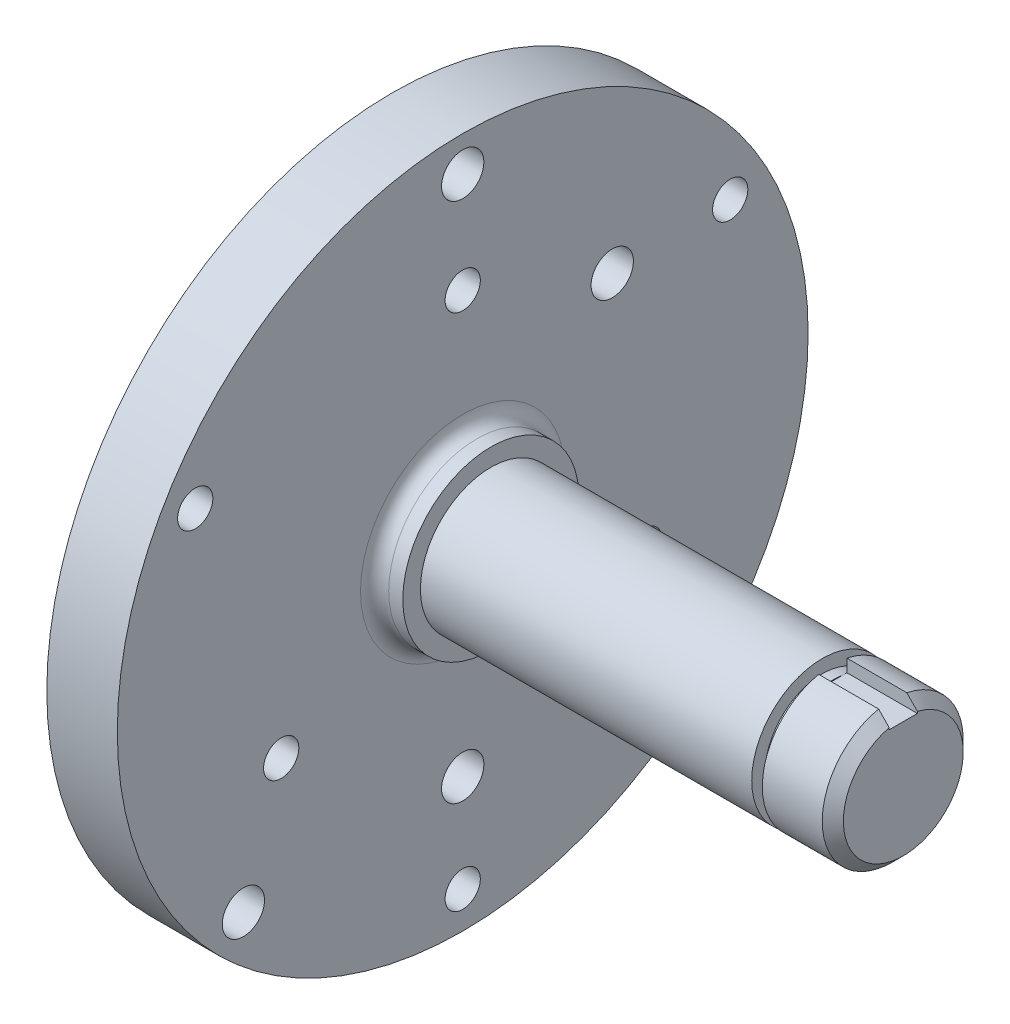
ISO-10303-21;
HEADER;
FILE_DESCRIPTION(('STEP AP214'),'2;1');
FILE_NAME('part.step','',(''),(''),'','','');
FILE_SCHEMA(('AUTOMOTIVE_DESIGN { 1 0 10303 214 1 1 1 1 }'));
ENDSEC;
DATA;
#1=APPLICATION_CONTEXT('core data for automotive mechanical design processes');
#2=APPLICATION_PROTOCOL_DEFINITION('international standard','automotive_design',2000,#1);
#3=PRODUCT_CONTEXT('',#1,'mechanical');
#4=PRODUCT('Part','Part','',(#3));
#5=PRODUCT_RELATED_PRODUCT_CATEGORY('part','',(#4));
#6=PRODUCT_DEFINITION_FORMATION('','',#4);
#7=PRODUCT_DEFINITION_CONTEXT('part definition',#1,'design');
#8=PRODUCT_DEFINITION('design','',#6,#7);
#9=PRODUCT_DEFINITION_SHAPE('','',#8);
#10=(LENGTH_UNIT() NAMED_UNIT(*) SI_UNIT(.MILLI.,.METRE.));
#11=(NAMED_UNIT(*) PLANE_ANGLE_UNIT() SI_UNIT($,.RADIAN.));
#12=(NAMED_UNIT(*) SI_UNIT($,.STERADIAN.) SOLID_ANGLE_UNIT());
#13=UNCERTAINTY_MEASURE_WITH_UNIT(LENGTH_MEASURE(1.E-05),#10,'distance_accuracy_value','');
#14=(GEOMETRIC_REPRESENTATION_CONTEXT(3) GLOBAL_UNCERTAINTY_ASSIGNED_CONTEXT((#13)) GLOBAL_UNIT_ASSIGNED_CONTEXT((#10,
#11,#12)) REPRESENTATION_CONTEXT('',''));
#15=CARTESIAN_POINT('',(0.,0.,0.));
#16=DIRECTION('',(0.,0.,1.));
#17=DIRECTION('',(1.,0.,0.));
#18=AXIS2_PLACEMENT_3D('',#15,#16,#17);
#19=CARTESIAN_POINT('',(58.5,8.50000000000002,0.));
#20=DIRECTION('',(-1.,0.,0.));
#21=DIRECTION('',(0.,0.,1.));
#22=AXIS2_PLACEMENT_3D('',#19,#20,#21);
#23=PLANE('',#22);
#24=CARTESIAN_POINT('',(58.5,0.,0.));
#25=DIRECTION('',(-1.,0.,0.));
#26=DIRECTION('',(0.,0.,1.));
#27=AXIS2_PLACEMENT_3D('',#24,#25,#26);
#28=CIRCLE('',#27,8.50000000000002);
#29=CARTESIAN_POINT('',(58.5,8.26135582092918,-2.));
#30=VERTEX_POINT('',#29);
#31=CARTESIAN_POINT('',(58.5,8.26135582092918,2.));
#32=VERTEX_POINT('',#31);
#33=EDGE_CURVE('E11',#30,#32,#28,.T.);
#34=ORIENTED_EDGE('',*,*,#33,.F.);
#35=DIRECTION('',(0.,1.,0.));
#36=VECTOR('',#35,1.);
#37=CARTESIAN_POINT('',(58.5,12.231945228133,-2.));
#38=LINE('',#37,#36);
#39=CARTESIAN_POINT('',(58.5,8.,-2.));
#40=VERTEX_POINT('',#39);
#41=EDGE_CURVE('E98',#40,#30,#38,.T.);
#42=ORIENTED_EDGE('',*,*,#41,.F.);
#43=DIRECTION('',(0.,0.,-1.));
#44=VECTOR('',#43,1.);
#45=CARTESIAN_POINT('',(58.5,8.,2.));
#46=LINE('',#45,#44);
#47=CARTESIAN_POINT('',(58.5,8.,2.));
#48=VERTEX_POINT('',#47);
#49=EDGE_CURVE('E97',#48,#40,#46,.T.);
#50=ORIENTED_EDGE('',*,*,#49,.F.);
#51=DIRECTION('',(0.,-1.,0.));
#52=VECTOR('',#51,1.);
#53=CARTESIAN_POINT('',(58.5,12.231945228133,2.));
#54=LINE('',#53,#52);
#55=EDGE_CURVE('E87',#32,#48,#54,.T.);
#56=ORIENTED_EDGE('',*,*,#55,.F.);
#57=EDGE_LOOP('',(#34,#42,#50,#56));
#58=FACE_BOUND('',#57,.T.);
#59=ADVANCED_FACE('F33',(#58),#23,.F.);
#60=CARTESIAN_POINT('',(58.5,0.,0.));
#61=DIRECTION('',(-1.,0.,0.));
#62=DIRECTION('',(0.,0.,1.));
#63=AXIS2_PLACEMENT_3D('',#60,#61,#62);
#64=CONICAL_SURFACE('',#63,8.50000000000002,0.785398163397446);
#65=CARTESIAN_POINT('',(57.,0.,0.));
#66=DIRECTION('',(-1.,0.,0.));
#67=DIRECTION('',(0.,0.,1.));
#68=AXIS2_PLACEMENT_3D('',#65,#66,#67);
#69=CIRCLE('',#68,10.);
#70=CARTESIAN_POINT('',(57.,9.79795897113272,-2.));
#71=VERTEX_POINT('',#70);
#72=CARTESIAN_POINT('',(57.,9.79795897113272,2.));
#73=VERTEX_POINT('',#72);
#74=EDGE_CURVE('E40',#71,#73,#69,.T.);
#75=ORIENTED_EDGE('',*,*,#74,.F.);
#76=CARTESIAN_POINT('',(54.9971938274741,11.8350055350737,-2.));
#77=CARTESIAN_POINT('',(55.2751644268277,11.553085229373,-2.));
#78=CARTESIAN_POINT('',(55.5530034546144,11.2710349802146,-2.));
#79=CARTESIAN_POINT('',(56.1083316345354,10.7065888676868,-2.));
#80=CARTESIAN_POINT('',(56.3858207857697,10.424193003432,-2.));
#81=CARTESIAN_POINT('',(56.9403495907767,9.85898306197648,-2.));
#82=CARTESIAN_POINT('',(57.2173892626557,9.57616900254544,-2.));
#83=CARTESIAN_POINT('',(57.7709001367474,9.00998552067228,-2.));
#84=CARTESIAN_POINT('',(58.0473713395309,8.72661609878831,-2.));
#85=CARTESIAN_POINT('',(58.5995749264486,8.15913155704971,-2.));
#86=CARTESIAN_POINT('',(58.8753072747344,7.87501640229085,-2.));
#87=CARTESIAN_POINT('',(59.425743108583,7.3057944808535,-2.));
#88=CARTESIAN_POINT('',(59.7004466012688,7.0206877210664,-2.));
#89=CARTESIAN_POINT('',(60.2484177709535,6.44907146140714,-2.));
#90=CARTESIAN_POINT('',(60.5216853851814,6.16256190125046,-2.));
#91=CARTESIAN_POINT('',(60.929972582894,5.73126239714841,-2.));
#92=CARTESIAN_POINT('',(61.0658008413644,5.58723835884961,-2.));
#93=CARTESIAN_POINT('',(61.3367727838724,5.29854588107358,-2.));
#94=CARTESIAN_POINT('',(61.4719164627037,5.15387743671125,-2.));
#95=CARTESIAN_POINT('',(61.6066441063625,5.00882099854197,-2.));
#96=B_SPLINE_CURVE_WITH_KNOTS('',3,(#76,#77,#78,#79,#80,#81,#82,#83,#84,#85,#86,#87,#88,#89,#90,
#91,#92,#93,#94,#95),.UNSPECIFIED.,.F.,.F.,(4,2,2,2,2,2,2,2,2,4),(0.,1.1877377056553,
2.37547846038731,3.56317011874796,4.75086058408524,5.93860766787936,7.12634651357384,
8.31413685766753,8.90804578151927,9.50195921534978),.UNSPECIFIED.);
#97=EDGE_CURVE('E55',#71,#30,#96,.T.);
#98=ORIENTED_EDGE('',*,*,#97,.T.);
#99=ORIENTED_EDGE('',*,*,#33,.T.);
#100=CARTESIAN_POINT('',(61.6066441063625,5.00882099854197,2.));
#101=CARTESIAN_POINT('',(61.4719164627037,5.15387743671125,2.));
#102=CARTESIAN_POINT('',(61.3367727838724,5.29854588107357,2.));
#103=CARTESIAN_POINT('',(61.0658008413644,5.5872383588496,2.));
#104=CARTESIAN_POINT('',(60.929972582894,5.7312623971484,2.));
#105=CARTESIAN_POINT('',(60.5216853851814,6.16256190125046,2.));
#106=CARTESIAN_POINT('',(60.2484177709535,6.44907146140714,2.));
#107=CARTESIAN_POINT('',(59.7004466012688,7.0206877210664,2.));
#108=CARTESIAN_POINT('',(59.425743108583,7.30579448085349,2.));
#109=CARTESIAN_POINT('',(58.8753072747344,7.87501640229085,2.));
#110=CARTESIAN_POINT('',(58.5995749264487,8.15913155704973,2.));
#111=CARTESIAN_POINT('',(58.0473713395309,8.72661609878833,2.));
#112=CARTESIAN_POINT('',(57.7709001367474,9.00998552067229,2.));
#113=CARTESIAN_POINT('',(57.2173892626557,9.57616900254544,2.));
#114=CARTESIAN_POINT('',(56.9403495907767,9.85898306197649,2.));
#115=CARTESIAN_POINT('',(56.3858207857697,10.424193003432,2.));
#116=CARTESIAN_POINT('',(56.1083316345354,10.7065888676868,2.));
#117=CARTESIAN_POINT('',(55.5530034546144,11.2710349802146,2.));
#118=CARTESIAN_POINT('',(55.2751644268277,11.553085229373,2.));
#119=CARTESIAN_POINT('',(54.9971938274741,11.8350055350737,2.));
#120=B_SPLINE_CURVE_WITH_KNOTS('',3,(#100,#101,#102,#103,#104,#105,#106,#107,#108,#109,#110,
#111,#112,#113,#114,#115,#116,#117,#118,#119),.UNSPECIFIED.,.F.,.F.,(4,2,2,2,2,2,2,2,2,4),(0.,
0.593913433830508,1.18782235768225,2.37561270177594,3.56335154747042,4.75109863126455,
5.93878909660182,7.12648075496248,8.31422150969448,9.50195921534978),.UNSPECIFIED.);
#121=EDGE_CURVE('E93',#32,#73,#120,.T.);
#122=ORIENTED_EDGE('',*,*,#121,.T.);
#123=EDGE_LOOP('',(#75,#98,#99,#122));
#124=FACE_BOUND('',#123,.T.);
#125=ADVANCED_FACE('F123',(#124),#64,.T.);
#126=CARTESIAN_POINT('',(-18.2864310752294,0.,0.));
#127=DIRECTION('',(-1.,0.,0.));
#128=DIRECTION('',(0.,0.,1.));
#129=AXIS2_PLACEMENT_3D('',#126,#127,#128);
#130=CYLINDRICAL_SURFACE('',#129,10.);
#131=CARTESIAN_POINT('',(48.5,0.,0.));
#132=DIRECTION('',(-1.,0.,0.));
#133=DIRECTION('',(0.,0.,1.));
#134=AXIS2_PLACEMENT_3D('',#131,#132,#133);
#135=CIRCLE('',#134,10.);
#136=CARTESIAN_POINT('',(48.5,9.79795897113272,-2.));
#137=VERTEX_POINT('',#136);
#138=CARTESIAN_POINT('',(48.5,9.79795897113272,2.));
#139=VERTEX_POINT('',#138);
#140=EDGE_CURVE('E230',#137,#139,#135,.T.);
#141=ORIENTED_EDGE('',*,*,#140,.F.);
#142=DIRECTION('',(-1.,0.,0.));
#143=VECTOR('',#142,1.);
#144=CARTESIAN_POINT('',(-18.2864310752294,9.79795897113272,-2.));
#145=LINE('',#144,#143);
#146=EDGE_CURVE('E121',#137,#71,#145,.F.);
#147=ORIENTED_EDGE('',*,*,#146,.T.);
#148=ORIENTED_EDGE('',*,*,#74,.T.);
#149=DIRECTION('',(-1.,0.,0.));
#150=VECTOR('',#149,1.);
#151=CARTESIAN_POINT('',(-18.2864310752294,9.79795897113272,2.));
#152=LINE('',#151,#150);
#153=EDGE_CURVE('E112',#73,#139,#152,.T.);
#154=ORIENTED_EDGE('',*,*,#153,.T.);
#155=EDGE_LOOP('',(#141,#147,#148,#154));
#156=FACE_BOUND('',#155,.T.);
#157=ADVANCED_FACE('F236',(#156),#130,.T.);
#158=CARTESIAN_POINT('',(48.5,8.12772302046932,0.));
#159=DIRECTION('',(1.,0.,0.));
#160=DIRECTION('',(0.,0.,-1.));
#161=AXIS2_PLACEMENT_3D('',#158,#159,#160);
#162=PLANE('',#161);
#163=DIRECTION('',(0.,0.,1.));
#164=VECTOR('',#163,1.);
#165=CARTESIAN_POINT('',(48.5,8.,2.));
#166=LINE('',#165,#164);
#167=CARTESIAN_POINT('',(48.5,8.,-2.));
#168=VERTEX_POINT('',#167);
#169=CARTESIAN_POINT('',(48.5,8.,-1.43522872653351));
#170=VERTEX_POINT('',#169);
#171=EDGE_CURVE('E47',#168,#170,#166,.T.);
#172=ORIENTED_EDGE('',*,*,#171,.F.);
#173=DIRECTION('',(0.,-1.,0.));
#174=VECTOR('',#173,1.);
#175=CARTESIAN_POINT('',(48.5,12.231945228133,-2.));
#176=LINE('',#175,#174);
#177=EDGE_CURVE('E115',#137,#168,#176,.T.);
#178=ORIENTED_EDGE('',*,*,#177,.F.);
#179=ORIENTED_EDGE('',*,*,#140,.T.);
#180=DIRECTION('',(0.,1.,0.));
#181=VECTOR('',#180,1.);
#182=CARTESIAN_POINT('',(48.5,12.231945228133,2.));
#183=LINE('',#182,#181);
#184=CARTESIAN_POINT('',(48.5,8.,2.));
#185=VERTEX_POINT('',#184);
#186=EDGE_CURVE('E110',#185,#139,#183,.T.);
#187=ORIENTED_EDGE('',*,*,#186,.F.);
#188=CARTESIAN_POINT('',(48.5,8.,1.43522872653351));
#189=VERTEX_POINT('',#188);
#190=EDGE_CURVE('E104',#189,#185,#166,.T.);
#191=ORIENTED_EDGE('',*,*,#190,.F.);
#192=CARTESIAN_POINT('',(48.5,0.,0.));
#193=DIRECTION('',(-1.,0.,0.));
#194=DIRECTION('',(0.,0.,1.));
#195=AXIS2_PLACEMENT_3D('',#192,#193,#194);
#196=CIRCLE('',#195,8.12772302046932);
#197=EDGE_CURVE('E226',#170,#189,#196,.T.);
#198=ORIENTED_EDGE('',*,*,#197,.F.);
#199=EDGE_LOOP('',(#172,#178,#179,#187,#191,#198));
#200=FACE_BOUND('',#199,.T.);
#201=ADVANCED_FACE('F243',(#200),#162,.F.);
#202=CARTESIAN_POINT('',(-18.2864310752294,0.,0.));
#203=DIRECTION('',(-1.,0.,0.));
#204=DIRECTION('',(0.,0.,1.));
#205=AXIS2_PLACEMENT_3D('',#202,#203,#204);
#206=CYLINDRICAL_SURFACE('',#205,8.12772302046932);
#207=CARTESIAN_POINT('',(47.,0.,0.));
#208=DIRECTION('',(-1.,0.,0.));
#209=DIRECTION('',(0.,0.,1.));
#210=AXIS2_PLACEMENT_3D('',#207,#208,#209);
#211=CIRCLE('',#210,8.12772302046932);
#212=CARTESIAN_POINT('',(47.,0.,8.12772302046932));
#213=VERTEX_POINT('',#212);
#214=EDGE_CURVE('E223',#213,#213,#211,.T.);
#215=ORIENTED_EDGE('',*,*,#214,.F.);
#216=EDGE_LOOP('',(#215));
#217=FACE_BOUND('',#216,.T.);
#218=EDGE_CURVE('E227',#189,#170,#196,.T.);
#219=ORIENTED_EDGE('',*,*,#218,.T.);
#220=ORIENTED_EDGE('',*,*,#197,.T.);
#221=EDGE_LOOP('',(#219,#220));
#222=FACE_BOUND('',#221,.T.);
#223=ADVANCED_FACE('F270',(#217,#222),#206,.T.);
#224=CARTESIAN_POINT('',(47.,10.,0.));
#225=DIRECTION('',(-1.,0.,0.));
#226=DIRECTION('',(0.,0.,1.));
#227=AXIS2_PLACEMENT_3D('',#224,#225,#226);
#228=PLANE('',#227);
#229=CARTESIAN_POINT('',(47.,0.,0.));
#230=DIRECTION('',(-1.,0.,0.));
#231=DIRECTION('',(0.,0.,1.));
#232=AXIS2_PLACEMENT_3D('',#229,#230,#231);
#233=CIRCLE('',#232,10.);
#234=CARTESIAN_POINT('',(47.,0.,10.));
#235=VERTEX_POINT('',#234);
#236=EDGE_CURVE('E220',#235,#235,#233,.T.);
#237=ORIENTED_EDGE('',*,*,#236,.F.);
#238=EDGE_LOOP('',(#237));
#239=FACE_BOUND('',#238,.T.);
#240=ORIENTED_EDGE('',*,*,#214,.T.);
#241=EDGE_LOOP('',(#240));
#242=FACE_BOUND('',#241,.T.);
#243=ADVANCED_FACE('F280',(#239,#242),#228,.F.);
#244=CARTESIAN_POINT('',(-18.2864310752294,0.,0.));
#245=DIRECTION('',(-1.,0.,0.));
#246=DIRECTION('',(0.,0.,1.));
#247=AXIS2_PLACEMENT_3D('',#244,#245,#246);
#248=CYLINDRICAL_SURFACE('',#247,10.);
#249=CARTESIAN_POINT('',(0.,0.,0.));
#250=DIRECTION('',(-1.,0.,0.));
#251=DIRECTION('',(0.,0.,1.));
#252=AXIS2_PLACEMENT_3D('',#249,#250,#251);
#253=CIRCLE('',#252,10.);
#254=CARTESIAN_POINT('',(0.,0.,10.));
#255=VERTEX_POINT('',#254);
#256=EDGE_CURVE('E217',#255,#255,#253,.T.);
#257=ORIENTED_EDGE('',*,*,#256,.F.);
#258=EDGE_LOOP('',(#257));
#259=FACE_BOUND('',#258,.T.);
#260=ORIENTED_EDGE('',*,*,#236,.T.);
#261=EDGE_LOOP('',(#260));
#262=FACE_BOUND('',#261,.T.);
#263=ADVANCED_FACE('F439',(#259,#262),#248,.T.);
#264=CARTESIAN_POINT('',(0.,12.5,0.));
#265=DIRECTION('',(-1.,0.,0.));
#266=DIRECTION('',(0.,0.,1.));
#267=AXIS2_PLACEMENT_3D('',#264,#265,#266);
#268=PLANE('',#267);
#269=CARTESIAN_POINT('',(0.,0.,0.));
#270=DIRECTION('',(-1.,0.,0.));
#271=DIRECTION('',(0.,0.,1.));
#272=AXIS2_PLACEMENT_3D('',#269,#270,#271);
#273=CIRCLE('',#272,12.5);
#274=CARTESIAN_POINT('',(0.,0.,12.5));
#275=VERTEX_POINT('',#274);
#276=EDGE_CURVE('E214',#275,#275,#273,.T.);
#277=ORIENTED_EDGE('',*,*,#276,.F.);
#278=EDGE_LOOP('',(#277));
#279=FACE_BOUND('',#278,.T.);
#280=ORIENTED_EDGE('',*,*,#256,.T.);
#281=EDGE_LOOP('',(#280));
#282=FACE_BOUND('',#281,.T.);
#283=ADVANCED_FACE('F431',(#279,#282),#268,.F.);
#284=CARTESIAN_POINT('',(-18.2864310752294,0.,0.));
#285=DIRECTION('',(-1.,0.,0.));
#286=DIRECTION('',(0.,0.,1.));
#287=AXIS2_PLACEMENT_3D('',#284,#285,#286);
#288=CYLINDRICAL_SURFACE('',#287,12.5);
#289=CARTESIAN_POINT('',(-1.99999999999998,0.,0.));
#290=DIRECTION('',(-1.,0.,0.));
#291=DIRECTION('',(0.,0.,1.));
#292=AXIS2_PLACEMENT_3D('',#289,#290,#291);
#293=CIRCLE('',#292,12.5);
#294=CARTESIAN_POINT('',(-1.99999999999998,0.,12.5));
#295=VERTEX_POINT('',#294);
#296=EDGE_CURVE('E211',#295,#295,#293,.T.);
#297=ORIENTED_EDGE('',*,*,#296,.F.);
#298=EDGE_LOOP('',(#297));
#299=FACE_BOUND('',#298,.T.);
#300=ORIENTED_EDGE('',*,*,#276,.T.);
#301=EDGE_LOOP('',(#300));
#302=FACE_BOUND('',#301,.T.);
#303=ADVANCED_FACE('F423',(#299,#302),#288,.T.);
#304=CARTESIAN_POINT('',(-1.99999999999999,0.,0.));
#305=DIRECTION('',(-1.,0.,0.));
#306=DIRECTION('',(0.,0.,1.));
#307=AXIS2_PLACEMENT_3D('',#304,#305,#306);
#308=TOROIDAL_SURFACE('',#307,14.5,2.);
#309=CARTESIAN_POINT('',(-3.99999999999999,0.,0.));
#310=DIRECTION('',(-1.,0.,0.));
#311=DIRECTION('',(0.,0.,1.));
#312=AXIS2_PLACEMENT_3D('',#309,#310,#311);
#313=CIRCLE('',#312,14.5);
#314=CARTESIAN_POINT('',(-3.99999999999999,0.,14.5));
#315=VERTEX_POINT('',#314);
#316=EDGE_CURVE('E208',#315,#315,#313,.T.);
#317=ORIENTED_EDGE('',*,*,#316,.F.);
#318=EDGE_LOOP('',(#317));
#319=FACE_BOUND('',#318,.T.);
#320=ORIENTED_EDGE('',*,*,#296,.T.);
#321=EDGE_LOOP('',(#320));
#322=FACE_BOUND('',#321,.T.);
#323=ADVANCED_FACE('F416',(#319,#322),#308,.F.);
#324=CARTESIAN_POINT('',(-4.,49.,0.));
#325=DIRECTION('',(-1.,0.,0.));
#326=DIRECTION('',(0.,0.,1.));
#327=AXIS2_PLACEMENT_3D('',#324,#325,#326);
#328=PLANE('',#327);
#329=CARTESIAN_POINT('',(-4.,-14.8660687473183,-25.7487863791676));
#330=DIRECTION('',(1.,0.,0.));
#331=DIRECTION('',(0.,0.,-1.));
#332=AXIS2_PLACEMENT_3D('',#329,#330,#331);
#333=CIRCLE('',#332,2.49999999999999);
#334=CARTESIAN_POINT('',(-4.,-14.8660687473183,-28.2487863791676));
#335=VERTEX_POINT('',#334);
#336=EDGE_CURVE('E145',#335,#335,#333,.T.);
#337=ORIENTED_EDGE('',*,*,#336,.F.);
#338=EDGE_LOOP('',(#337));
#339=FACE_BOUND('',#338,.T.);
#340=CARTESIAN_POINT('',(-4.,21.9089023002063,37.9473319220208));
#341=DIRECTION('',(1.,0.,0.));
#342=DIRECTION('',(0.,0.,-1.));
#343=AXIS2_PLACEMENT_3D('',#340,#341,#342);
#344=CIRCLE('',#343,2.49999999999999);
#345=CARTESIAN_POINT('',(-4.,21.9089023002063,35.4473319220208));
#346=VERTEX_POINT('',#345);
#347=EDGE_CURVE('E151',#346,#346,#344,.T.);
#348=ORIENTED_EDGE('',*,*,#347,.F.);
#349=EDGE_LOOP('',(#348));
#350=FACE_BOUND('',#349,.T.);
#351=CARTESIAN_POINT('',(-4.,-14.8660687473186,25.7487863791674));
#352=DIRECTION('',(1.,0.,0.));
#353=DIRECTION('',(0.,0.,-1.));
#354=AXIS2_PLACEMENT_3D('',#351,#352,#353);
#355=CIRCLE('',#354,2.49999999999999);
#356=CARTESIAN_POINT('',(-4.,-14.8660687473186,23.2487863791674));
#357=VERTEX_POINT('',#356);
#358=EDGE_CURVE('E157',#357,#357,#355,.T.);
#359=ORIENTED_EDGE('',*,*,#358,.F.);
#360=EDGE_LOOP('',(#359));
#361=FACE_BOUND('',#360,.T.);
#362=CARTESIAN_POINT('',(-4.,21.9089023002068,-37.9473319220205));
#363=DIRECTION('',(1.,0.,0.));
#364=DIRECTION('',(0.,0.,-1.));
#365=AXIS2_PLACEMENT_3D('',#362,#363,#364);
#366=CIRCLE('',#365,2.49999999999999);
#367=CARTESIAN_POINT('',(-4.,21.9089023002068,-40.4473319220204));
#368=VERTEX_POINT('',#367);
#369=EDGE_CURVE('E163',#368,#368,#366,.T.);
#370=ORIENTED_EDGE('',*,*,#369,.F.);
#371=EDGE_LOOP('',(#370));
#372=FACE_BOUND('',#371,.T.);
#373=CARTESIAN_POINT('',(-4.,29.732137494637,0.));
#374=DIRECTION('',(1.,0.,0.));
#375=DIRECTION('',(0.,0.,-1.));
#376=AXIS2_PLACEMENT_3D('',#373,#374,#375);
#377=CIRCLE('',#376,2.49999999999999);
#378=CARTESIAN_POINT('',(-4.,29.732137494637,-2.49999999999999));
#379=VERTEX_POINT('',#378);
#380=EDGE_CURVE('E169',#379,#379,#377,.T.);
#381=ORIENTED_EDGE('',*,*,#380,.F.);
#382=EDGE_LOOP('',(#381));
#383=FACE_BOUND('',#382,.T.);
#384=CARTESIAN_POINT('',(-4.,-43.8178046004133,0.));
#385=DIRECTION('',(1.,0.,0.));
#386=DIRECTION('',(0.,0.,-1.));
#387=AXIS2_PLACEMENT_3D('',#384,#385,#386);
#388=CIRCLE('',#387,2.49999999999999);
#389=CARTESIAN_POINT('',(-4.,-43.8178046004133,-2.49999999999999));
#390=VERTEX_POINT('',#389);
#391=EDGE_CURVE('E175',#390,#390,#388,.T.);
#392=ORIENTED_EDGE('',*,*,#391,.F.);
#393=EDGE_LOOP('',(#392));
#394=FACE_BOUND('',#393,.T.);
#395=CARTESIAN_POINT('',(-3.99999999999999,-31.1126983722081,31.112698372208));
#396=DIRECTION('',(-1.,0.,0.));
#397=DIRECTION('',(0.,0.,1.));
#398=AXIS2_PLACEMENT_3D('',#395,#396,#397);
#399=CIRCLE('',#398,3.);
#400=CARTESIAN_POINT('',(-3.99999999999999,-31.1126983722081,34.112698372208));
#401=VERTEX_POINT('',#400);
#402=EDGE_CURVE('E181',#401,#401,#399,.F.);
#403=ORIENTED_EDGE('',*,*,#402,.F.);
#404=EDGE_LOOP('',(#403));
#405=FACE_BOUND('',#404,.T.);
#406=CARTESIAN_POINT('',(-3.99999999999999,44.,0.));
#407=DIRECTION('',(-1.,0.,0.));
#408=DIRECTION('',(0.,0.,1.));
#409=AXIS2_PLACEMENT_3D('',#406,#407,#408);
#410=CIRCLE('',#409,3.);
#411=CARTESIAN_POINT('',(-3.99999999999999,44.,3.));
#412=VERTEX_POINT('',#411);
#413=EDGE_CURVE('E187',#412,#412,#410,.F.);
#414=ORIENTED_EDGE('',*,*,#413,.F.);
#415=EDGE_LOOP('',(#414));
#416=FACE_BOUND('',#415,.T.);
#417=CARTESIAN_POINT('',(-3.99999999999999,21.2132034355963,-21.2132034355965));
#418=DIRECTION('',(-1.,0.,0.));
#419=DIRECTION('',(0.,0.,1.));
#420=AXIS2_PLACEMENT_3D('',#417,#418,#419);
#421=CIRCLE('',#420,2.99999999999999);
#422=CARTESIAN_POINT('',(-3.99999999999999,21.2132034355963,-18.2132034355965));
#423=VERTEX_POINT('',#422);
#424=EDGE_CURVE('E193',#423,#423,#421,.F.);
#425=ORIENTED_EDGE('',*,*,#424,.F.);
#426=EDGE_LOOP('',(#425));
#427=FACE_BOUND('',#426,.T.);
#428=CARTESIAN_POINT('',(-3.99999999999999,-30.,0.));
#429=DIRECTION('',(-1.,0.,0.));
#430=DIRECTION('',(0.,0.,1.));
#431=AXIS2_PLACEMENT_3D('',#428,#429,#430);
#432=CIRCLE('',#431,3.);
#433=CARTESIAN_POINT('',(-3.99999999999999,-30.,3.00000000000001));
#434=VERTEX_POINT('',#433);
#435=EDGE_CURVE('E199',#434,#434,#432,.F.);
#436=ORIENTED_EDGE('',*,*,#435,.F.);
#437=EDGE_LOOP('',(#436));
#438=FACE_BOUND('',#437,.T.);
#439=CARTESIAN_POINT('',(-4.,0.,0.));
#440=DIRECTION('',(-1.,0.,0.));
#441=DIRECTION('',(0.,0.,1.));
#442=AXIS2_PLACEMENT_3D('',#439,#440,#441);
#443=CIRCLE('',#442,49.);
#444=CARTESIAN_POINT('',(-4.,0.,49.));
#445=VERTEX_POINT('',#444);
#446=EDGE_CURVE('E205',#445,#445,#443,.T.);
#447=ORIENTED_EDGE('',*,*,#446,.F.);
#448=EDGE_LOOP('',(#447));
#449=FACE_BOUND('',#448,.T.);
#450=ORIENTED_EDGE('',*,*,#316,.T.);
#451=EDGE_LOOP('',(#450));
#452=FACE_BOUND('',#451,.T.);
#453=ADVANCED_FACE('F408',(#339,#350,#361,#372,#383,#394,#405,#416,#427,#438,#449,#452),#328,.F.);
#454=CARTESIAN_POINT('',(-18.2864310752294,0.,0.));
#455=DIRECTION('',(-1.,0.,0.));
#456=DIRECTION('',(0.,0.,1.));
#457=AXIS2_PLACEMENT_3D('',#454,#455,#456);
#458=CYLINDRICAL_SURFACE('',#457,49.);
#459=CARTESIAN_POINT('',(-14.,0.,0.));
#460=DIRECTION('',(-1.,0.,0.));
#461=DIRECTION('',(0.,0.,1.));
#462=AXIS2_PLACEMENT_3D('',#459,#460,#461);
#463=CIRCLE('',#462,49.);
#464=CARTESIAN_POINT('',(-14.,0.,49.));
#465=VERTEX_POINT('',#464);
#466=EDGE_CURVE('E202',#465,#465,#463,.T.);
#467=ORIENTED_EDGE('',*,*,#466,.F.);
#468=EDGE_LOOP('',(#467));
#469=FACE_BOUND('',#468,.T.);
#470=ORIENTED_EDGE('',*,*,#446,.T.);
#471=EDGE_LOOP('',(#470));
#472=FACE_BOUND('',#471,.T.);
#473=ADVANCED_FACE('F401',(#469,#472),#458,.T.);
#474=CARTESIAN_POINT('',(-14.,0.,0.));
#475=DIRECTION('',(1.,0.,0.));
#476=DIRECTION('',(0.,0.,-1.));
#477=AXIS2_PLACEMENT_3D('',#474,#475,#476);
#478=PLANE('',#477);
#479=CARTESIAN_POINT('',(-14.,-14.8660687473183,-25.7487863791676));
#480=DIRECTION('',(1.,0.,0.));
#481=DIRECTION('',(0.,0.,-1.));
#482=AXIS2_PLACEMENT_3D('',#479,#480,#481);
#483=CIRCLE('',#482,2.49999999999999);
#484=CARTESIAN_POINT('',(-14.,-14.8660687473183,-28.2487863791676));
#485=VERTEX_POINT('',#484);
#486=EDGE_CURVE('E142',#485,#485,#483,.T.);
#487=ORIENTED_EDGE('',*,*,#486,.T.);
#488=EDGE_LOOP('',(#487));
#489=FACE_BOUND('',#488,.T.);
#490=CARTESIAN_POINT('',(-14.,21.9089023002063,37.9473319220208));
#491=DIRECTION('',(1.,0.,0.));
#492=DIRECTION('',(0.,0.,-1.));
#493=AXIS2_PLACEMENT_3D('',#490,#491,#492);
#494=CIRCLE('',#493,2.49999999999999);
#495=CARTESIAN_POINT('',(-14.,21.9089023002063,35.4473319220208));
#496=VERTEX_POINT('',#495);
#497=EDGE_CURVE('E148',#496,#496,#494,.T.);
#498=ORIENTED_EDGE('',*,*,#497,.T.);
#499=EDGE_LOOP('',(#498));
#500=FACE_BOUND('',#499,.T.);
#501=CARTESIAN_POINT('',(-14.,-14.8660687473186,25.7487863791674));
#502=DIRECTION('',(1.,0.,0.));
#503=DIRECTION('',(0.,0.,-1.));
#504=AXIS2_PLACEMENT_3D('',#501,#502,#503);
#505=CIRCLE('',#504,2.49999999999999);
#506=CARTESIAN_POINT('',(-14.,-14.8660687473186,23.2487863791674));
#507=VERTEX_POINT('',#506);
#508=EDGE_CURVE('E154',#507,#507,#505,.T.);
#509=ORIENTED_EDGE('',*,*,#508,.T.);
#510=EDGE_LOOP('',(#509));
#511=FACE_BOUND('',#510,.T.);
#512=CARTESIAN_POINT('',(-14.,21.9089023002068,-37.9473319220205));
#513=DIRECTION('',(1.,0.,0.));
#514=DIRECTION('',(0.,0.,-1.));
#515=AXIS2_PLACEMENT_3D('',#512,#513,#514);
#516=CIRCLE('',#515,2.49999999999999);
#517=CARTESIAN_POINT('',(-14.,21.9089023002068,-40.4473319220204));
#518=VERTEX_POINT('',#517);
#519=EDGE_CURVE('E160',#518,#518,#516,.T.);
#520=ORIENTED_EDGE('',*,*,#519,.T.);
#521=EDGE_LOOP('',(#520));
#522=FACE_BOUND('',#521,.T.);
#523=CARTESIAN_POINT('',(-14.,29.732137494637,0.));
#524=DIRECTION('',(1.,0.,0.));
#525=DIRECTION('',(0.,0.,-1.));
#526=AXIS2_PLACEMENT_3D('',#523,#524,#525);
#527=CIRCLE('',#526,2.49999999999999);
#528=CARTESIAN_POINT('',(-14.,29.732137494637,-2.49999999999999));
#529=VERTEX_POINT('',#528);
#530=EDGE_CURVE('E166',#529,#529,#527,.T.);
#531=ORIENTED_EDGE('',*,*,#530,.T.);
#532=EDGE_LOOP('',(#531));
#533=FACE_BOUND('',#532,.T.);
#534=CARTESIAN_POINT('',(-14.,-43.8178046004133,0.));
#535=DIRECTION('',(1.,0.,0.));
#536=DIRECTION('',(0.,0.,-1.));
#537=AXIS2_PLACEMENT_3D('',#534,#535,#536);
#538=CIRCLE('',#537,2.49999999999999);
#539=CARTESIAN_POINT('',(-14.,-43.8178046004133,-2.49999999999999));
#540=VERTEX_POINT('',#539);
#541=EDGE_CURVE('E172',#540,#540,#538,.T.);
#542=ORIENTED_EDGE('',*,*,#541,.T.);
#543=EDGE_LOOP('',(#542));
#544=FACE_BOUND('',#543,.T.);
#545=CARTESIAN_POINT('',(-14.,-31.1126983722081,31.112698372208));
#546=DIRECTION('',(-1.,0.,0.));
#547=DIRECTION('',(0.,0.,1.));
#548=AXIS2_PLACEMENT_3D('',#545,#546,#547);
#549=CIRCLE('',#548,3.);
#550=CARTESIAN_POINT('',(-14.,-31.1126983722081,34.112698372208));
#551=VERTEX_POINT('',#550);
#552=EDGE_CURVE('E178',#551,#551,#549,.T.);
#553=ORIENTED_EDGE('',*,*,#552,.F.);
#554=EDGE_LOOP('',(#553));
#555=FACE_BOUND('',#554,.T.);
#556=CARTESIAN_POINT('',(-14.,44.,0.));
#557=DIRECTION('',(-1.,0.,0.));
#558=DIRECTION('',(0.,0.,1.));
#559=AXIS2_PLACEMENT_3D('',#556,#557,#558);
#560=CIRCLE('',#559,3.);
#561=CARTESIAN_POINT('',(-14.,44.,3.));
#562=VERTEX_POINT('',#561);
#563=EDGE_CURVE('E184',#562,#562,#560,.T.);
#564=ORIENTED_EDGE('',*,*,#563,.F.);
#565=EDGE_LOOP('',(#564));
#566=FACE_BOUND('',#565,.T.);
#567=CARTESIAN_POINT('',(-14.,21.2132034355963,-21.2132034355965));
#568=DIRECTION('',(-1.,0.,0.));
#569=DIRECTION('',(0.,0.,1.));
#570=AXIS2_PLACEMENT_3D('',#567,#568,#569);
#571=CIRCLE('',#570,2.99999999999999);
#572=CARTESIAN_POINT('',(-14.,21.2132034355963,-18.2132034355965));
#573=VERTEX_POINT('',#572);
#574=EDGE_CURVE('E190',#573,#573,#571,.T.);
#575=ORIENTED_EDGE('',*,*,#574,.F.);
#576=EDGE_LOOP('',(#575));
#577=FACE_BOUND('',#576,.T.);
#578=CARTESIAN_POINT('',(-14.,-30.,0.));
#579=DIRECTION('',(-1.,0.,0.));
#580=DIRECTION('',(0.,0.,1.));
#581=AXIS2_PLACEMENT_3D('',#578,#579,#580);
#582=CIRCLE('',#581,3.);
#583=CARTESIAN_POINT('',(-14.,-30.,3.00000000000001));
#584=VERTEX_POINT('',#583);
#585=EDGE_CURVE('E196',#584,#584,#582,.T.);
#586=ORIENTED_EDGE('',*,*,#585,.F.);
#587=EDGE_LOOP('',(#586));
#588=FACE_BOUND('',#587,.T.);
#589=ORIENTED_EDGE('',*,*,#466,.T.);
#590=EDGE_LOOP('',(#589));
#591=FACE_BOUND('',#590,.T.);
#592=ADVANCED_FACE('F393',(#489,#500,#511,#522,#533,#544,#555,#566,#577,#588,#591),#478,.F.);
#593=CARTESIAN_POINT('',(58.501,-30.,0.));
#594=DIRECTION('',(-1.,0.,0.));
#595=DIRECTION('',(0.,0.,1.));
#596=AXIS2_PLACEMENT_3D('',#593,#594,#595);
#597=CYLINDRICAL_SURFACE('',#596,3.);
#598=ORIENTED_EDGE('',*,*,#585,.T.);
#599=EDGE_LOOP('',(#598));
#600=FACE_BOUND('',#599,.T.);
#601=ORIENTED_EDGE('',*,*,#435,.T.);
#602=EDGE_LOOP('',(#601));
#603=FACE_BOUND('',#602,.T.);
#604=ADVANCED_FACE('F385',(#600,#603),#597,.F.);
#605=CARTESIAN_POINT('',(58.501,21.2132034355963,-21.2132034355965));
#606=DIRECTION('',(-1.,0.,0.));
#607=DIRECTION('',(0.,0.,1.));
#608=AXIS2_PLACEMENT_3D('',#605,#606,#607);
#609=CYLINDRICAL_SURFACE('',#608,2.99999999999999);
#610=ORIENTED_EDGE('',*,*,#574,.T.);
#611=EDGE_LOOP('',(#610));
#612=FACE_BOUND('',#611,.T.);
#613=ORIENTED_EDGE('',*,*,#424,.T.);
#614=EDGE_LOOP('',(#613));
#615=FACE_BOUND('',#614,.T.);
#616=ADVANCED_FACE('F377',(#612,#615),#609,.F.);
#617=CARTESIAN_POINT('',(58.501,44.,0.));
#618=DIRECTION('',(-1.,0.,0.));
#619=DIRECTION('',(0.,0.,1.));
#620=AXIS2_PLACEMENT_3D('',#617,#618,#619);
#621=CYLINDRICAL_SURFACE('',#620,3.);
#622=ORIENTED_EDGE('',*,*,#563,.T.);
#623=EDGE_LOOP('',(#622));
#624=FACE_BOUND('',#623,.T.);
#625=ORIENTED_EDGE('',*,*,#413,.T.);
#626=EDGE_LOOP('',(#625));
#627=FACE_BOUND('',#626,.T.);
#628=ADVANCED_FACE('F369',(#624,#627),#621,.F.);
#629=CARTESIAN_POINT('',(58.501,-31.1126983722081,31.112698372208));
#630=DIRECTION('',(-1.,0.,0.));
#631=DIRECTION('',(0.,0.,1.));
#632=AXIS2_PLACEMENT_3D('',#629,#630,#631);
#633=CYLINDRICAL_SURFACE('',#632,3.);
#634=ORIENTED_EDGE('',*,*,#552,.T.);
#635=EDGE_LOOP('',(#634));
#636=FACE_BOUND('',#635,.T.);
#637=ORIENTED_EDGE('',*,*,#402,.T.);
#638=EDGE_LOOP('',(#637));
#639=FACE_BOUND('',#638,.T.);
#640=ADVANCED_FACE('F361',(#636,#639),#633,.F.);
#641=CARTESIAN_POINT('',(-4.,-43.8178046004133,0.));
#642=DIRECTION('',(1.,0.,0.));
#643=DIRECTION('',(0.,0.,-1.));
#644=AXIS2_PLACEMENT_3D('',#641,#642,#643);
#645=CYLINDRICAL_SURFACE('',#644,2.49999999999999);
#646=ORIENTED_EDGE('',*,*,#541,.F.);
#647=EDGE_LOOP('',(#646));
#648=FACE_BOUND('',#647,.T.);
#649=ORIENTED_EDGE('',*,*,#391,.T.);
#650=EDGE_LOOP('',(#649));
#651=FACE_BOUND('',#650,.T.);
#652=ADVANCED_FACE('F352',(#648,#651),#645,.F.);
#653=CARTESIAN_POINT('',(-4.,29.732137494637,0.));
#654=DIRECTION('',(1.,0.,0.));
#655=DIRECTION('',(0.,0.,-1.));
#656=AXIS2_PLACEMENT_3D('',#653,#654,#655);
#657=CYLINDRICAL_SURFACE('',#656,2.49999999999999);
#658=ORIENTED_EDGE('',*,*,#530,.F.);
#659=EDGE_LOOP('',(#658));
#660=FACE_BOUND('',#659,.T.);
#661=ORIENTED_EDGE('',*,*,#380,.T.);
#662=EDGE_LOOP('',(#661));
#663=FACE_BOUND('',#662,.T.);
#664=ADVANCED_FACE('F343',(#660,#663),#657,.F.);
#665=CARTESIAN_POINT('',(-4.,21.9089023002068,-37.9473319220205));
#666=DIRECTION('',(1.,0.,0.));
#667=DIRECTION('',(0.,0.,-1.));
#668=AXIS2_PLACEMENT_3D('',#665,#666,#667);
#669=CYLINDRICAL_SURFACE('',#668,2.49999999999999);
#670=ORIENTED_EDGE('',*,*,#519,.F.);
#671=EDGE_LOOP('',(#670));
#672=FACE_BOUND('',#671,.T.);
#673=ORIENTED_EDGE('',*,*,#369,.T.);
#674=EDGE_LOOP('',(#673));
#675=FACE_BOUND('',#674,.T.);
#676=ADVANCED_FACE('F335',(#672,#675),#669,.F.);
#677=CARTESIAN_POINT('',(-4.,-14.8660687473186,25.7487863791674));
#678=DIRECTION('',(1.,0.,0.));
#679=DIRECTION('',(0.,0.,-1.));
#680=AXIS2_PLACEMENT_3D('',#677,#678,#679);
#681=CYLINDRICAL_SURFACE('',#680,2.49999999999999);
#682=ORIENTED_EDGE('',*,*,#508,.F.);
#683=EDGE_LOOP('',(#682));
#684=FACE_BOUND('',#683,.T.);
#685=ORIENTED_EDGE('',*,*,#358,.T.);
#686=EDGE_LOOP('',(#685));
#687=FACE_BOUND('',#686,.T.);
#688=ADVANCED_FACE('F328',(#684,#687),#681,.F.);
#689=CARTESIAN_POINT('',(-4.,21.9089023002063,37.9473319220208));
#690=DIRECTION('',(1.,0.,0.));
#691=DIRECTION('',(0.,0.,-1.));
#692=AXIS2_PLACEMENT_3D('',#689,#690,#691);
#693=CYLINDRICAL_SURFACE('',#692,2.49999999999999);
#694=ORIENTED_EDGE('',*,*,#497,.F.);
#695=EDGE_LOOP('',(#694));
#696=FACE_BOUND('',#695,.T.);
#697=ORIENTED_EDGE('',*,*,#347,.T.);
#698=EDGE_LOOP('',(#697));
#699=FACE_BOUND('',#698,.T.);
#700=ADVANCED_FACE('F324',(#696,#699),#693,.F.);
#701=CARTESIAN_POINT('',(-4.,-14.8660687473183,-25.7487863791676));
#702=DIRECTION('',(1.,0.,0.));
#703=DIRECTION('',(0.,0.,-1.));
#704=AXIS2_PLACEMENT_3D('',#701,#702,#703);
#705=CYLINDRICAL_SURFACE('',#704,2.49999999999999);
#706=ORIENTED_EDGE('',*,*,#486,.F.);
#707=EDGE_LOOP('',(#706));
#708=FACE_BOUND('',#707,.T.);
#709=ORIENTED_EDGE('',*,*,#336,.T.);
#710=EDGE_LOOP('',(#709));
#711=FACE_BOUND('',#710,.T.);
#712=ADVANCED_FACE('F136',(#708,#711),#705,.F.);
#713=CARTESIAN_POINT('',(42.676825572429,12.231945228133,-2.));
#714=DIRECTION('',(0.,0.,-1.));
#715=DIRECTION('',(0.,1.,0.));
#716=AXIS2_PLACEMENT_3D('',#713,#714,#715);
#717=PLANE('',#716);
#718=ORIENTED_EDGE('',*,*,#146,.F.);
#719=ORIENTED_EDGE('',*,*,#177,.T.);
#720=DIRECTION('',(1.,0.,0.));
#721=VECTOR('',#720,1.);
#722=CARTESIAN_POINT('',(42.676825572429,8.,-2.));
#723=LINE('',#722,#721);
#724=EDGE_CURVE('E105',#168,#40,#723,.T.);
#725=ORIENTED_EDGE('',*,*,#724,.T.);
#726=ORIENTED_EDGE('',*,*,#41,.T.);
#727=ORIENTED_EDGE('',*,*,#97,.F.);
#728=EDGE_LOOP('',(#718,#719,#725,#726,#727));
#729=FACE_BOUND('',#728,.T.);
#730=ADVANCED_FACE('F131',(#729),#717,.F.);
#731=CARTESIAN_POINT('',(42.676825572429,12.231945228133,2.));
#732=DIRECTION('',(0.,0.,1.));
#733=DIRECTION('',(0.,-1.,0.));
#734=AXIS2_PLACEMENT_3D('',#731,#732,#733);
#735=PLANE('',#734);
#736=ORIENTED_EDGE('',*,*,#55,.T.);
#737=DIRECTION('',(1.,0.,0.));
#738=VECTOR('',#737,1.);
#739=CARTESIAN_POINT('',(42.676825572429,8.,2.));
#740=LINE('',#739,#738);
#741=EDGE_CURVE('E90',#185,#48,#740,.T.);
#742=ORIENTED_EDGE('',*,*,#741,.F.);
#743=ORIENTED_EDGE('',*,*,#186,.T.);
#744=ORIENTED_EDGE('',*,*,#153,.F.);
#745=ORIENTED_EDGE('',*,*,#121,.F.);
#746=EDGE_LOOP('',(#736,#742,#743,#744,#745));
#747=FACE_BOUND('',#746,.T.);
#748=ADVANCED_FACE('F89',(#747),#735,.F.);
#749=CARTESIAN_POINT('',(48.5,8.12772302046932,0.));
#750=DIRECTION('',(1.,0.,0.));
#751=DIRECTION('',(0.,0.,-1.));
#752=AXIS2_PLACEMENT_3D('',#749,#750,#751);
#753=PLANE('',#752);
#754=ORIENTED_EDGE('',*,*,#218,.F.);
#755=EDGE_CURVE('E314',#170,#189,#166,.T.);
#756=ORIENTED_EDGE('',*,*,#755,.F.);
#757=EDGE_LOOP('',(#754,#756));
#758=FACE_BOUND('',#757,.T.);
#759=ADVANCED_FACE('F130',(#758),#753,.T.);
#760=CARTESIAN_POINT('',(42.676825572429,8.,2.));
#761=DIRECTION('',(0.,-1.,0.));
#762=DIRECTION('',(0.,0.,-1.));
#763=AXIS2_PLACEMENT_3D('',#760,#761,#762);
#764=PLANE('',#763);
#765=ORIENTED_EDGE('',*,*,#171,.T.);
#766=ORIENTED_EDGE('',*,*,#755,.T.);
#767=ORIENTED_EDGE('',*,*,#190,.T.);
#768=ORIENTED_EDGE('',*,*,#741,.T.);
#769=ORIENTED_EDGE('',*,*,#49,.T.);
#770=ORIENTED_EDGE('',*,*,#724,.F.);
#771=EDGE_LOOP('',(#765,#766,#767,#768,#769,#770));
#772=FACE_BOUND('',#771,.T.);
#773=ADVANCED_FACE('F101',(#772),#764,.F.);
#774=CLOSED_SHELL('',(#59,#125,#157,#201,#223,#243,#263,#283,#303,#323,#453,#473,#592,#604,#616,
#628,#640,#652,#664,#676,#688,#700,#712,#730,#748,#759,#773));
#775=MANIFOLD_SOLID_BREP('B2',#774);
#776=ADVANCED_BREP_SHAPE_REPRESENTATION('',(#18,#775),#14);
#777=SHAPE_DEFINITION_REPRESENTATION(#9,#776);
ENDSEC;
END-ISO-10303-21;
